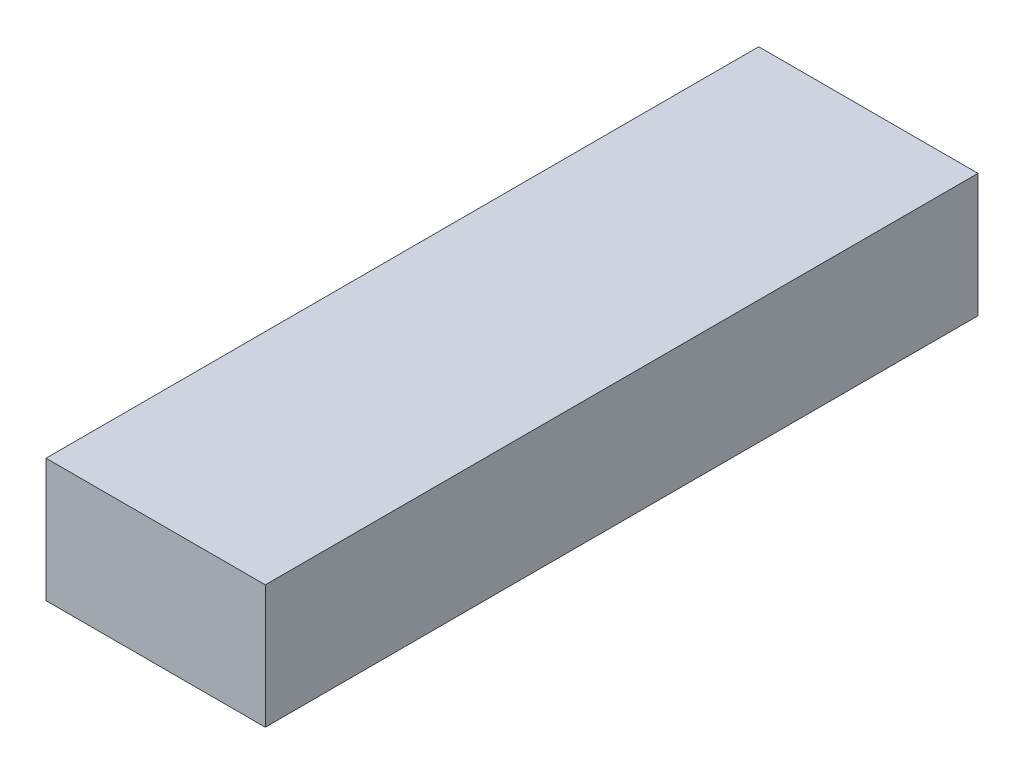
ISO-10303-21;
HEADER;
FILE_DESCRIPTION(('STEP AP214'),'2;1');
FILE_NAME('part.step','',(''),(''),'','','');
FILE_SCHEMA(('AUTOMOTIVE_DESIGN { 1 0 10303 214 1 1 1 1 }'));
ENDSEC;
DATA;
#1=APPLICATION_CONTEXT('core data for automotive mechanical design processes');
#2=APPLICATION_PROTOCOL_DEFINITION('international standard','automotive_design',2000,#1);
#3=PRODUCT_CONTEXT('',#1,'mechanical');
#4=PRODUCT('Part','Part','',(#3));
#5=PRODUCT_RELATED_PRODUCT_CATEGORY('part','',(#4));
#6=PRODUCT_DEFINITION_FORMATION('','',#4);
#7=PRODUCT_DEFINITION_CONTEXT('part definition',#1,'design');
#8=PRODUCT_DEFINITION('design','',#6,#7);
#9=PRODUCT_DEFINITION_SHAPE('','',#8);
#10=(LENGTH_UNIT() NAMED_UNIT(*) SI_UNIT(.MILLI.,.METRE.));
#11=(NAMED_UNIT(*) PLANE_ANGLE_UNIT() SI_UNIT($,.RADIAN.));
#12=(NAMED_UNIT(*) SI_UNIT($,.STERADIAN.) SOLID_ANGLE_UNIT());
#13=UNCERTAINTY_MEASURE_WITH_UNIT(LENGTH_MEASURE(1.E-05),#10,'distance_accuracy_value','');
#14=(GEOMETRIC_REPRESENTATION_CONTEXT(3) GLOBAL_UNCERTAINTY_ASSIGNED_CONTEXT((#13)) GLOBAL_UNIT_ASSIGNED_CONTEXT((#10,
#11,#12)) REPRESENTATION_CONTEXT('',''));
#15=CARTESIAN_POINT('',(0.,0.,0.));
#16=DIRECTION('',(0.,0.,1.));
#17=DIRECTION('',(1.,0.,0.));
#18=AXIS2_PLACEMENT_3D('',#15,#16,#17);
#19=CARTESIAN_POINT('',(8.,4.5,52.));
#20=DIRECTION('',(-1.,0.,0.));
#21=DIRECTION('',(0.,0.,1.));
#22=AXIS2_PLACEMENT_3D('',#19,#20,#21);
#23=PLANE('',#22);
#24=DIRECTION('',(0.,1.,0.));
#25=VECTOR('',#24,1.);
#26=CARTESIAN_POINT('',(8.,4.5,0.));
#27=LINE('',#26,#25);
#28=CARTESIAN_POINT('',(8.,-4.5,0.));
#29=VERTEX_POINT('',#28);
#30=CARTESIAN_POINT('',(8.,4.5,0.));
#31=VERTEX_POINT('',#30);
#32=EDGE_CURVE('E98',#29,#31,#27,.T.);
#33=ORIENTED_EDGE('',*,*,#32,.T.);
#34=DIRECTION('',(0.,0.,-1.));
#35=VECTOR('',#34,1.);
#36=CARTESIAN_POINT('',(8.,4.5,52.));
#37=LINE('',#36,#35);
#38=CARTESIAN_POINT('',(8.,4.5,52.));
#39=VERTEX_POINT('',#38);
#40=EDGE_CURVE('E11',#39,#31,#37,.T.);
#41=ORIENTED_EDGE('',*,*,#40,.F.);
#42=DIRECTION('',(0.,1.,0.));
#43=VECTOR('',#42,1.);
#44=CARTESIAN_POINT('',(8.,4.5,52.));
#45=LINE('',#44,#43);
#46=CARTESIAN_POINT('',(8.,-4.5,52.));
#47=VERTEX_POINT('',#46);
#48=EDGE_CURVE('E86',#47,#39,#45,.T.);
#49=ORIENTED_EDGE('',*,*,#48,.F.);
#50=DIRECTION('',(0.,0.,-1.));
#51=VECTOR('',#50,1.);
#52=CARTESIAN_POINT('',(8.,-4.5,52.));
#53=LINE('',#52,#51);
#54=EDGE_CURVE('E94',#47,#29,#53,.T.);
#55=ORIENTED_EDGE('',*,*,#54,.T.);
#56=EDGE_LOOP('',(#33,#41,#49,#55));
#57=FACE_BOUND('',#56,.T.);
#58=ADVANCED_FACE('F35',(#57),#23,.F.);
#59=CARTESIAN_POINT('',(-8.,4.5,52.));
#60=DIRECTION('',(0.,-1.,0.));
#61=DIRECTION('',(0.,0.,-1.));
#62=AXIS2_PLACEMENT_3D('',#59,#60,#61);
#63=PLANE('',#62);
#64=DIRECTION('',(-1.,0.,0.));
#65=VECTOR('',#64,1.);
#66=CARTESIAN_POINT('',(-8.,4.5,0.));
#67=LINE('',#66,#65);
#68=CARTESIAN_POINT('',(-8.,4.5,0.));
#69=VERTEX_POINT('',#68);
#70=EDGE_CURVE('E90',#31,#69,#67,.T.);
#71=ORIENTED_EDGE('',*,*,#70,.T.);
#72=DIRECTION('',(0.,0.,-1.));
#73=VECTOR('',#72,1.);
#74=CARTESIAN_POINT('',(-8.,4.5,52.));
#75=LINE('',#74,#73);
#76=CARTESIAN_POINT('',(-8.,4.5,52.));
#77=VERTEX_POINT('',#76);
#78=EDGE_CURVE('E43',#77,#69,#75,.T.);
#79=ORIENTED_EDGE('',*,*,#78,.F.);
#80=DIRECTION('',(-1.,0.,0.));
#81=VECTOR('',#80,1.);
#82=CARTESIAN_POINT('',(-8.,4.5,52.));
#83=LINE('',#82,#81);
#84=EDGE_CURVE('E81',#39,#77,#83,.T.);
#85=ORIENTED_EDGE('',*,*,#84,.F.);
#86=ORIENTED_EDGE('',*,*,#40,.T.);
#87=EDGE_LOOP('',(#71,#79,#85,#86));
#88=FACE_BOUND('',#87,.T.);
#89=ADVANCED_FACE('F89',(#88),#63,.F.);
#90=CARTESIAN_POINT('',(-8.,4.5,52.));
#91=DIRECTION('',(1.,0.,0.));
#92=DIRECTION('',(0.,0.,-1.));
#93=AXIS2_PLACEMENT_3D('',#90,#91,#92);
#94=PLANE('',#93);
#95=DIRECTION('',(0.,-1.,0.));
#96=VECTOR('',#95,1.);
#97=CARTESIAN_POINT('',(-8.,4.5,0.));
#98=LINE('',#97,#96);
#99=CARTESIAN_POINT('',(-8.,-4.5,0.));
#100=VERTEX_POINT('',#99);
#101=EDGE_CURVE('E68',#69,#100,#98,.T.);
#102=ORIENTED_EDGE('',*,*,#101,.T.);
#103=DIRECTION('',(0.,0.,-1.));
#104=VECTOR('',#103,1.);
#105=CARTESIAN_POINT('',(-8.,-4.5,52.));
#106=LINE('',#105,#104);
#107=CARTESIAN_POINT('',(-8.,-4.5,52.));
#108=VERTEX_POINT('',#107);
#109=EDGE_CURVE('E91',#108,#100,#106,.T.);
#110=ORIENTED_EDGE('',*,*,#109,.F.);
#111=DIRECTION('',(0.,-1.,0.));
#112=VECTOR('',#111,1.);
#113=CARTESIAN_POINT('',(-8.,4.5,52.));
#114=LINE('',#113,#112);
#115=EDGE_CURVE('E84',#77,#108,#114,.T.);
#116=ORIENTED_EDGE('',*,*,#115,.F.);
#117=ORIENTED_EDGE('',*,*,#78,.T.);
#118=EDGE_LOOP('',(#102,#110,#116,#117));
#119=FACE_BOUND('',#118,.T.);
#120=ADVANCED_FACE('F92',(#119),#94,.F.);
#121=CARTESIAN_POINT('',(-8.,-4.5,52.));
#122=DIRECTION('',(0.,1.,0.));
#123=DIRECTION('',(0.,0.,1.));
#124=AXIS2_PLACEMENT_3D('',#121,#122,#123);
#125=PLANE('',#124);
#126=DIRECTION('',(1.,0.,0.));
#127=VECTOR('',#126,1.);
#128=CARTESIAN_POINT('',(-8.,-4.5,0.));
#129=LINE('',#128,#127);
#130=EDGE_CURVE('E74',#100,#29,#129,.T.);
#131=ORIENTED_EDGE('',*,*,#130,.T.);
#132=ORIENTED_EDGE('',*,*,#54,.F.);
#133=DIRECTION('',(1.,0.,0.));
#134=VECTOR('',#133,1.);
#135=CARTESIAN_POINT('',(-8.,-4.5,52.));
#136=LINE('',#135,#134);
#137=EDGE_CURVE('E51',#108,#47,#136,.T.);
#138=ORIENTED_EDGE('',*,*,#137,.F.);
#139=ORIENTED_EDGE('',*,*,#109,.T.);
#140=EDGE_LOOP('',(#131,#132,#138,#139));
#141=FACE_BOUND('',#140,.T.);
#142=ADVANCED_FACE('F105',(#141),#125,.F.);
#143=CARTESIAN_POINT('',(0.,0.,52.));
#144=DIRECTION('',(0.,0.,1.));
#145=DIRECTION('',(1.,0.,0.));
#146=AXIS2_PLACEMENT_3D('',#143,#144,#145);
#147=PLANE('',#146);
#148=ORIENTED_EDGE('',*,*,#48,.T.);
#149=ORIENTED_EDGE('',*,*,#84,.T.);
#150=ORIENTED_EDGE('',*,*,#115,.T.);
#151=ORIENTED_EDGE('',*,*,#137,.T.);
#152=EDGE_LOOP('',(#148,#149,#150,#151));
#153=FACE_BOUND('',#152,.T.);
#154=ADVANCED_FACE('F82',(#153),#147,.T.);
#155=CARTESIAN_POINT('',(0.,0.,0.));
#156=DIRECTION('',(0.,0.,1.));
#157=DIRECTION('',(1.,0.,0.));
#158=AXIS2_PLACEMENT_3D('',#155,#156,#157);
#159=PLANE('',#158);
#160=ORIENTED_EDGE('',*,*,#32,.F.);
#161=ORIENTED_EDGE('',*,*,#130,.F.);
#162=ORIENTED_EDGE('',*,*,#101,.F.);
#163=ORIENTED_EDGE('',*,*,#70,.F.);
#164=EDGE_LOOP('',(#160,#161,#162,#163));
#165=FACE_BOUND('',#164,.T.);
#166=ADVANCED_FACE('F108',(#165),#159,.F.);
#167=CLOSED_SHELL('',(#58,#89,#120,#142,#154,#166));
#168=MANIFOLD_SOLID_BREP('B2',#167);
#169=ADVANCED_BREP_SHAPE_REPRESENTATION('',(#18,#168),#14);
#170=SHAPE_DEFINITION_REPRESENTATION(#9,#169);
ENDSEC;
END-ISO-10303-21;
